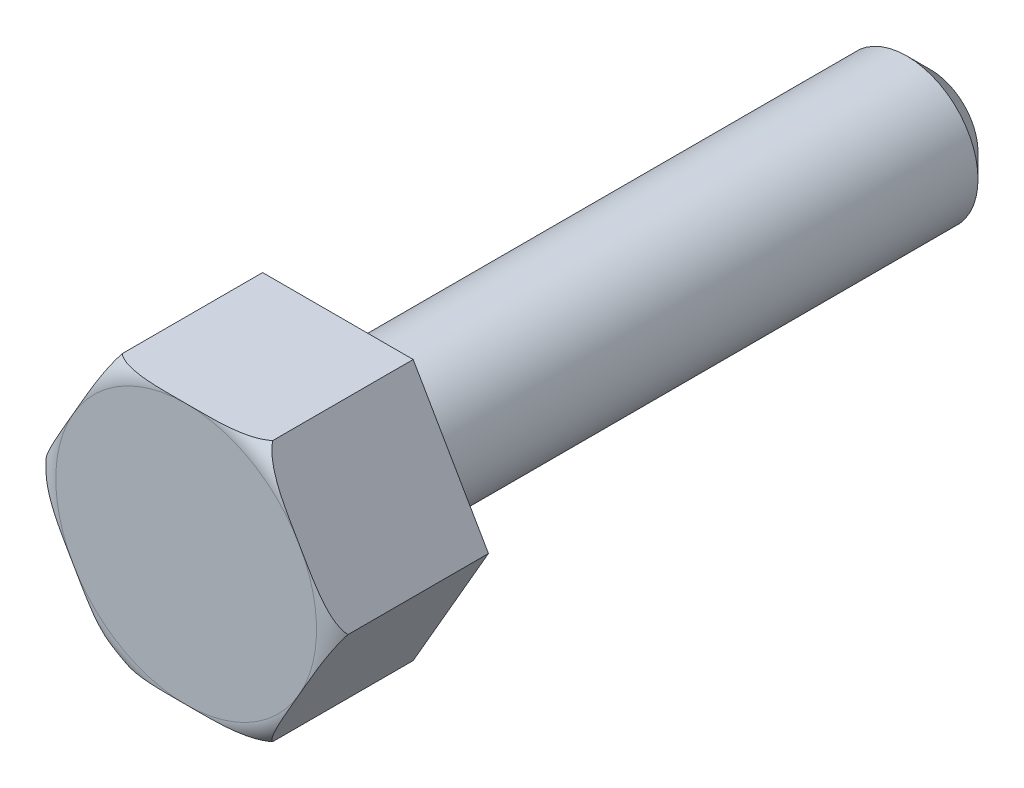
ISO-10303-21;
HEADER;
FILE_DESCRIPTION(('STEP AP214'),'2;1');
FILE_NAME('part.step','',(''),(''),'','','');
FILE_SCHEMA(('AUTOMOTIVE_DESIGN { 1 0 10303 214 1 1 1 1 }'));
ENDSEC;
DATA;
#1=APPLICATION_CONTEXT('core data for automotive mechanical design processes');
#2=APPLICATION_PROTOCOL_DEFINITION('international standard','automotive_design',2000,#1);
#3=PRODUCT_CONTEXT('',#1,'mechanical');
#4=PRODUCT('Part','Part','',(#3));
#5=PRODUCT_RELATED_PRODUCT_CATEGORY('part','',(#4));
#6=PRODUCT_DEFINITION_FORMATION('','',#4);
#7=PRODUCT_DEFINITION_CONTEXT('part definition',#1,'design');
#8=PRODUCT_DEFINITION('design','',#6,#7);
#9=PRODUCT_DEFINITION_SHAPE('','',#8);
#10=(LENGTH_UNIT() NAMED_UNIT(*) SI_UNIT(.MILLI.,.METRE.));
#11=(NAMED_UNIT(*) PLANE_ANGLE_UNIT() SI_UNIT($,.RADIAN.));
#12=(NAMED_UNIT(*) SI_UNIT($,.STERADIAN.) SOLID_ANGLE_UNIT());
#13=UNCERTAINTY_MEASURE_WITH_UNIT(LENGTH_MEASURE(1.E-05),#10,'distance_accuracy_value','');
#14=(GEOMETRIC_REPRESENTATION_CONTEXT(3) GLOBAL_UNCERTAINTY_ASSIGNED_CONTEXT((#13)) GLOBAL_UNIT_ASSIGNED_CONTEXT((#10,
#11,#12)) REPRESENTATION_CONTEXT('',''));
#15=CARTESIAN_POINT('',(0.,0.,0.));
#16=DIRECTION('',(0.,0.,1.));
#17=DIRECTION('',(1.,0.,0.));
#18=AXIS2_PLACEMENT_3D('',#15,#16,#17);
#19=CARTESIAN_POINT('',(0.,0.,0.));
#20=DIRECTION('',(0.,0.,1.));
#21=DIRECTION('',(1.,0.,0.));
#22=AXIS2_PLACEMENT_3D('',#19,#20,#21);
#23=PLANE('',#22);
#24=DIRECTION('',(0.5,0.866025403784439,0.));
#25=VECTOR('',#24,1.);
#26=CARTESIAN_POINT('',(3.17542648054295,-5.5,0.));
#27=LINE('',#26,#25);
#28=CARTESIAN_POINT('',(3.17542648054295,-5.5,0.));
#29=VERTEX_POINT('',#28);
#30=CARTESIAN_POINT('',(6.35085296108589,0.,0.));
#31=VERTEX_POINT('',#30);
#32=EDGE_CURVE('E39',#29,#31,#27,.T.);
#33=ORIENTED_EDGE('',*,*,#32,.F.);
#34=DIRECTION('',(1.,0.,0.));
#35=VECTOR('',#34,1.);
#36=CARTESIAN_POINT('',(-3.17542648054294,-5.5,0.));
#37=LINE('',#36,#35);
#38=CARTESIAN_POINT('',(-3.17542648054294,-5.5,0.));
#39=VERTEX_POINT('',#38);
#40=EDGE_CURVE('E121',#39,#29,#37,.T.);
#41=ORIENTED_EDGE('',*,*,#40,.F.);
#42=DIRECTION('',(0.5,-0.866025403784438,0.));
#43=VECTOR('',#42,1.);
#44=CARTESIAN_POINT('',(-6.35085296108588,0.,0.));
#45=LINE('',#44,#43);
#46=CARTESIAN_POINT('',(-6.35085296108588,0.,0.));
#47=VERTEX_POINT('',#46);
#48=EDGE_CURVE('E119',#47,#39,#45,.T.);
#49=ORIENTED_EDGE('',*,*,#48,.F.);
#50=DIRECTION('',(-0.5,-0.866025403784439,0.));
#51=VECTOR('',#50,1.);
#52=CARTESIAN_POINT('',(-3.17542648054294,5.5,0.));
#53=LINE('',#52,#51);
#54=CARTESIAN_POINT('',(-3.17542648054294,5.5,0.));
#55=VERTEX_POINT('',#54);
#56=EDGE_CURVE('E101',#55,#47,#53,.T.);
#57=ORIENTED_EDGE('',*,*,#56,.F.);
#58=DIRECTION('',(-1.,0.,0.));
#59=VECTOR('',#58,1.);
#60=CARTESIAN_POINT('',(3.17542648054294,5.5,0.));
#61=LINE('',#60,#59);
#62=CARTESIAN_POINT('',(3.17542648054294,5.5,0.));
#63=VERTEX_POINT('',#62);
#64=EDGE_CURVE('E110',#63,#55,#61,.T.);
#65=ORIENTED_EDGE('',*,*,#64,.F.);
#66=DIRECTION('',(-0.5,0.866025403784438,0.));
#67=VECTOR('',#66,1.);
#68=CARTESIAN_POINT('',(6.35085296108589,0.,0.));
#69=LINE('',#68,#67);
#70=EDGE_CURVE('E114',#31,#63,#69,.T.);
#71=ORIENTED_EDGE('',*,*,#70,.F.);
#72=EDGE_LOOP('',(#33,#41,#49,#57,#65,#71));
#73=FACE_BOUND('',#72,.T.);
#74=CARTESIAN_POINT('',(0.,0.,0.));
#75=DIRECTION('',(0.,0.,1.));
#76=DIRECTION('',(1.,0.,0.));
#77=AXIS2_PLACEMENT_3D('',#74,#75,#76);
#78=CIRCLE('',#77,3.);
#79=CARTESIAN_POINT('',(3.,0.,0.));
#80=VERTEX_POINT('',#79);
#81=EDGE_CURVE('E234',#80,#80,#78,.F.);
#82=ORIENTED_EDGE('',*,*,#81,.F.);
#83=EDGE_LOOP('',(#82));
#84=FACE_BOUND('',#83,.T.);
#85=ADVANCED_FACE('F24',(#73,#84),#23,.F.);
#86=CARTESIAN_POINT('',(0.,0.,5.4));
#87=DIRECTION('',(0.,0.,1.));
#88=DIRECTION('',(1.,0.,0.));
#89=AXIS2_PLACEMENT_3D('',#86,#87,#88);
#90=TOROIDAL_SURFACE('',#89,5.5,1.);
#91=CARTESIAN_POINT('',(0.,0.,6.4));
#92=DIRECTION('',(0.,0.,1.));
#93=DIRECTION('',(1.,0.,0.));
#94=AXIS2_PLACEMENT_3D('',#91,#92,#93);
#95=CIRCLE('',#94,5.5);
#96=CARTESIAN_POINT('',(4.76314265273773,-2.74999492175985,6.4));
#97=VERTEX_POINT('',#96);
#98=CARTESIAN_POINT('',(4.76313535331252,2.75000756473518,6.4));
#99=VERTEX_POINT('',#98);
#100=EDGE_CURVE('E131',#97,#99,#95,.T.);
#101=ORIENTED_EDGE('',*,*,#100,.F.);
#102=CARTESIAN_POINT('',(3.1753110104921,-5.50019999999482,5.92521683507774));
#103=CARTESIAN_POINT('',(3.19204964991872,-5.47120782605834,5.95230103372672));
#104=CARTESIAN_POINT('',(3.20952045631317,-5.44094750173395,5.97743459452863));
#105=CARTESIAN_POINT('',(3.24553671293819,-5.37856551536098,6.02417092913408));
#106=CARTESIAN_POINT('',(3.26407874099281,-5.34644978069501,6.04578418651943));
#107=CARTESIAN_POINT('',(3.32024084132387,-5.24917416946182,6.10543178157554));
#108=CARTESIAN_POINT('',(3.35899303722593,-5.18205339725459,6.13916841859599));
#109=CARTESIAN_POINT('',(3.44690474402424,-5.02978585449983,6.204254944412));
#110=CARTESIAN_POINT('',(3.49645581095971,-4.94396088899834,6.23338941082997));
#111=CARTESIAN_POINT('',(3.5967479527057,-4.77024980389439,6.28202540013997));
#112=CARTESIAN_POINT('',(3.6474907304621,-4.68236073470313,6.30151213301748));
#113=CARTESIAN_POINT('',(3.75032002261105,-4.5042551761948,6.3337017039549));
#114=CARTESIAN_POINT('',(3.8024150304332,-4.41402397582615,6.34629058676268));
#115=CARTESIAN_POINT('',(3.90680084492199,-4.2332224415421,6.36631100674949));
#116=CARTESIAN_POINT('',(3.95909149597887,-4.14265237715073,6.37374601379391));
#117=CARTESIAN_POINT('',(4.05934858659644,-3.96900200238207,6.38463652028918));
#118=CARTESIAN_POINT('',(4.10730801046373,-3.88593384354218,6.3883746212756));
#119=CARTESIAN_POINT('',(4.20325632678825,-3.71974648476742,6.39392233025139));
#120=CARTESIAN_POINT('',(4.25124522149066,-3.63662728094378,6.39573176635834));
#121=CARTESIAN_POINT('',(4.34724849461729,-3.47034473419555,6.39822111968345));
#122=CARTESIAN_POINT('',(4.39526287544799,-3.3871813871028,6.3989005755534));
#123=CARTESIAN_POINT('',(4.49129046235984,-3.22085672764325,6.39972406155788));
#124=CARTESIAN_POINT('',(4.53930366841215,-3.13769541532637,6.39986811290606));
#125=CARTESIAN_POINT('',(4.63499658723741,-2.97195041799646,6.40000529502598));
#126=CARTESIAN_POINT('',(4.6826763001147,-2.88936673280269,6.3999994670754));
#127=CARTESIAN_POINT('',(4.77803620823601,-2.72419852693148,6.4000003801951));
#128=CARTESIAN_POINT('',(4.82571640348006,-2.64161400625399,6.40000712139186));
#129=CARTESIAN_POINT('',(4.92106671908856,-2.47646241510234,6.39997335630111));
#130=CARTESIAN_POINT('',(4.96873683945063,-2.39389534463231,6.39993286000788));
#131=CARTESIAN_POINT('',(5.06407658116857,-2.22876206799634,6.39952529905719));
#132=CARTESIAN_POINT('',(5.11174620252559,-2.14619586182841,6.39915823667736));
#133=CARTESIAN_POINT('',(5.21225117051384,-1.97211615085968,6.39752797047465));
#134=CARTESIAN_POINT('',(5.26508624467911,-1.88060311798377,6.39617192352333));
#135=CARTESIAN_POINT('',(5.37074827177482,-1.69759111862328,6.39151281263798));
#136=CARTESIAN_POINT('',(5.4235752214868,-1.60609215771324,6.38820939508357));
#137=CARTESIAN_POINT('',(5.52932106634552,-1.42293498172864,6.37838403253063));
#138=CARTESIAN_POINT('',(5.5822397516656,-1.33127713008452,6.37185231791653));
#139=CARTESIAN_POINT('',(5.68787258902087,-1.14831568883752,6.35396290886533));
#140=CARTESIAN_POINT('',(5.74058680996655,-1.05701197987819,6.34260701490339));
#141=CARTESIAN_POINT('',(5.82421396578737,-0.912165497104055,6.31901443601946));
#142=CARTESIAN_POINT('',(5.85528265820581,-0.858352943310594,6.30901027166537));
#143=CARTESIAN_POINT('',(5.91714121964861,-0.751210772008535,6.28603008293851));
#144=CARTESIAN_POINT('',(5.94793115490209,-0.697881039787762,6.27305478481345));
#145=CARTESIAN_POINT('',(6.00888571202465,-0.592304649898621,6.24358892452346));
#146=CARTESIAN_POINT('',(6.03905309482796,-0.540053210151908,6.22712171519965));
#147=CARTESIAN_POINT('',(6.09870854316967,-0.436726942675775,6.18987188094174));
#148=CARTESIAN_POINT('',(6.12819682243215,-0.385651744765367,6.16909063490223));
#149=CARTESIAN_POINT('',(6.19155906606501,-0.275905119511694,6.11789743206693));
#150=CARTESIAN_POINT('',(6.2252264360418,-0.217591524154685,6.08641249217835));
#151=CARTESIAN_POINT('',(6.27396150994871,-0.133179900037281,6.03203709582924));
#152=CARTESIAN_POINT('',(6.28999100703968,-0.105415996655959,6.01260036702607));
#153=CARTESIAN_POINT('',(6.3211929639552,-0.0513726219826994,5.97101474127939));
#154=CARTESIAN_POINT('',(6.33636339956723,-0.0250966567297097,5.94885979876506));
#155=CARTESIAN_POINT('',(6.35096843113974,0.000200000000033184,5.92521683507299));
#156=B_SPLINE_CURVE_WITH_KNOTS('',3,(#102,#103,#104,#105,#106,#107,#108,#109,#110,#111,#112,
#113,#114,#115,#116,#117,#118,#119,#120,#121,#122,#123,#124,#125,#126,#127,#128,#129,#130,#131,
#132,#133,#134,#135,#136,#137,#138,#139,#140,#141,#142,#143,#144,#145,#146,#147,#148,#149,#150,
#151,#152,#153,#154,#155),.UNSPECIFIED.,.F.,.F.,(4,2,2,2,2,2,2,2,2,2,2,2,2,2,2,2,2,2,2,2,2,2,2,
2,2,2,4),(0.,0.128983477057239,0.257575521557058,0.510346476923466,0.819564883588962,
1.12925586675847,1.4439196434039,1.75837136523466,2.04631874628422,2.33429178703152,
2.62238237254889,2.91046154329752,3.1965398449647,3.48262102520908,3.76864168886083,
4.05466035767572,4.37168855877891,4.68877434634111,5.00682564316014,5.32475834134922,
5.51351411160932,5.70222379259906,5.8897091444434,6.07713466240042,6.2994825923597,
6.41183333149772,6.524438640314),.UNSPECIFIED.);
#157=CARTESIAN_POINT('',(6.35085296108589,0.,5.92540388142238));
#158=VERTEX_POINT('',#157);
#159=EDGE_CURVE('E194',#97,#158,#156,.T.);
#160=ORIENTED_EDGE('',*,*,#159,.T.);
#161=CARTESIAN_POINT('',(6.35096843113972,-0.000200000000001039,5.92521683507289));
#162=CARTESIAN_POINT('',(6.33422979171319,0.0287921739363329,5.95230103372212));
#163=CARTESIAN_POINT('',(6.3167589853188,0.0590524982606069,5.97743459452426));
#164=CARTESIAN_POINT('',(6.28074272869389,0.121434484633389,6.02417092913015));
#165=CARTESIAN_POINT('',(6.26220070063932,0.153550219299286,6.04578418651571));
#166=CARTESIAN_POINT('',(6.20603860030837,0.250825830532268,6.10543178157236));
#167=CARTESIAN_POINT('',(6.16728640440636,0.317946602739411,6.13916841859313));
#168=CARTESIAN_POINT('',(6.0793746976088,0.470214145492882,6.20425494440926));
#169=CARTESIAN_POINT('',(6.02982363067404,0.556039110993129,6.23338941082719));
#170=CARTESIAN_POINT('',(5.92953148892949,0.729750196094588,6.28202540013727));
#171=CARTESIAN_POINT('',(5.87878871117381,0.817639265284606,6.3015121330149));
#172=CARTESIAN_POINT('',(5.77595941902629,0.995744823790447,6.33370170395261));
#173=CARTESIAN_POINT('',(5.72386441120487,1.08597602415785,6.34629058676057));
#174=CARTESIAN_POINT('',(5.6194785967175,1.26677755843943,6.36631100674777));
#175=CARTESIAN_POINT('',(5.56718794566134,1.35734762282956,6.3737460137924));
#176=CARTESIAN_POINT('',(5.46693085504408,1.53099799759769,6.38463652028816));
#177=CARTESIAN_POINT('',(5.41897143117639,1.61406615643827,6.3883746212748));
#178=CARTESIAN_POINT('',(5.32302311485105,1.78025351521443,6.39392233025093));
#179=CARTESIAN_POINT('',(5.27503422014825,1.86337271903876,6.395731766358));
#180=CARTESIAN_POINT('',(5.1790309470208,2.02965526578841,6.39822111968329));
#181=CARTESIAN_POINT('',(5.13101656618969,2.11281861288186,6.39890057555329));
#182=CARTESIAN_POINT('',(5.03498897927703,2.27914327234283,6.39972406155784));
#183=CARTESIAN_POINT('',(4.98697577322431,2.36230458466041,6.39986811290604));
#184=CARTESIAN_POINT('',(4.89128285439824,2.52804958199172,6.40000529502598));
#185=CARTESIAN_POINT('',(4.84360314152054,2.61063326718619,6.3999994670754));
#186=CARTESIAN_POINT('',(4.74824323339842,2.77580147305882,6.4000003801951));
#187=CARTESIAN_POINT('',(4.70056303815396,2.85838599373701,6.40000712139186));
#188=CARTESIAN_POINT('',(4.60521272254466,3.02353758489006,6.39997335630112));
#189=CARTESIAN_POINT('',(4.55754260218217,3.1061046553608,6.39993286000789));
#190=CARTESIAN_POINT('',(4.46220286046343,3.27123793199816,6.39952529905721));
#191=CARTESIAN_POINT('',(4.414533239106,3.3538041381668,6.39915823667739));
#192=CARTESIAN_POINT('',(4.31402827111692,3.52788384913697,6.3975279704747));
#193=CARTESIAN_POINT('',(4.26119319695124,3.6193968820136,6.39617192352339));
#194=CARTESIAN_POINT('',(4.15553116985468,3.80240888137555,6.39151281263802));
#195=CARTESIAN_POINT('',(4.10270422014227,3.89390784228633,6.3882093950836));
#196=CARTESIAN_POINT('',(3.99695837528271,4.07706501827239,6.37838403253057));
#197=CARTESIAN_POINT('',(3.94403968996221,4.16872286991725,6.3718523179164));
#198=CARTESIAN_POINT('',(3.8384068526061,4.35168431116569,6.35396290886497));
#199=CARTESIAN_POINT('',(3.78569263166,4.44298802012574,6.34260701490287));
#200=CARTESIAN_POINT('',(3.70206547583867,4.58783450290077,6.3190144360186));
#201=CARTESIAN_POINT('',(3.67099678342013,4.6416470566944,6.3090102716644));
#202=CARTESIAN_POINT('',(3.60913822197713,4.7487892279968,6.28603008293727));
#203=CARTESIAN_POINT('',(3.57834828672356,4.80211896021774,6.27305478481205));
#204=CARTESIAN_POINT('',(3.51739372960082,4.9076953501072,6.2435889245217));
#205=CARTESIAN_POINT('',(3.48722634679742,4.95994678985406,6.22712171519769));
#206=CARTESIAN_POINT('',(3.42757089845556,5.06327305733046,6.1898718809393));
#207=CARTESIAN_POINT('',(3.39808261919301,5.11434825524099,6.16909063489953));
#208=CARTESIAN_POINT('',(3.33472037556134,5.22409488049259,6.11789743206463));
#209=CARTESIAN_POINT('',(3.30105300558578,5.28240847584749,6.08641249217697));
#210=CARTESIAN_POINT('',(3.25231793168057,5.36682009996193,6.03203709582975));
#211=CARTESIAN_POINT('',(3.23628843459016,5.39458400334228,6.0126003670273));
#212=CARTESIAN_POINT('',(3.20508647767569,5.44862737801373,5.97101474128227));
#213=CARTESIAN_POINT('',(3.18991604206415,5.47490334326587,5.94885979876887));
#214=CARTESIAN_POINT('',(3.17531101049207,5.50019999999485,5.92521683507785));
#215=B_SPLINE_CURVE_WITH_KNOTS('',3,(#161,#162,#163,#164,#165,#166,#167,#168,#169,#170,#171,
#172,#173,#174,#175,#176,#177,#178,#179,#180,#181,#182,#183,#184,#185,#186,#187,#188,#189,#190,
#191,#192,#193,#194,#195,#196,#197,#198,#199,#200,#201,#202,#203,#204,#205,#206,#207,#208,#209,
#210,#211,#212,#213,#214),.UNSPECIFIED.,.F.,.F.,(4,2,2,2,2,2,2,2,2,2,2,2,2,2,2,2,2,2,2,2,2,2,2,
2,2,2,4),(0.,0.128983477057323,0.257575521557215,0.510346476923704,0.819564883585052,
1.1292558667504,1.4439196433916,1.75837136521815,2.04631874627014,2.33429178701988,
2.6223823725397,2.91046154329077,3.19653984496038,3.4826210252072,3.76864168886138,
4.0546603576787,4.37168855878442,4.68877434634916,5.00682564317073,5.32475834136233,
5.51351411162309,5.70222379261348,5.88970914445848,6.07713466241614,6.29948259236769,
6.41183333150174,6.52443864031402),.UNSPECIFIED.);
#216=EDGE_CURVE('E162',#158,#99,#215,.T.);
#217=ORIENTED_EDGE('',*,*,#216,.T.);
#218=EDGE_LOOP('',(#101,#160,#217));
#219=FACE_BOUND('',#218,.T.);
#220=ADVANCED_FACE('F250',(#219),#90,.T.);
#221=CARTESIAN_POINT('',(0.,-5.5,6.4));
#222=VERTEX_POINT('',#221);
#223=EDGE_CURVE('E156',#222,#97,#95,.T.);
#224=ORIENTED_EDGE('',*,*,#223,.F.);
#225=CARTESIAN_POINT('',(0.,-5.5,6.4000000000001));
#226=CARTESIAN_POINT('',(0.0832868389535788,-5.5,6.40000014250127));
#227=CARTESIAN_POINT('',(0.166573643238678,-5.5,6.40000673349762));
#228=CARTESIAN_POINT('',(0.333148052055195,-5.5,6.39996108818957));
#229=CARTESIAN_POINT('',(0.416435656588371,-5.5,6.39990885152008));
#230=CARTESIAN_POINT('',(0.666420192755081,-5.5,6.3994120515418));
#231=CARTESIAN_POINT('',(0.833115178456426,-5.5,6.39862697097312));
#232=CARTESIAN_POINT('',(1.16696160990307,-5.5,6.39322457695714));
#233=CARTESIAN_POINT('',(1.33411301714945,-5.5,6.38859646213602));
#234=CARTESIAN_POINT('',(1.58442259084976,-5.5,6.37504656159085));
#235=CARTESIAN_POINT('',(1.66774786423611,-5.5,6.36943310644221));
#236=CARTESIAN_POINT('',(1.83413173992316,-5.5,6.35517088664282));
#237=CARTESIAN_POINT('',(1.91719039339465,-5.5,6.34652274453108));
#238=CARTESIAN_POINT('',(2.08442682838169,-5.5,6.32500581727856));
#239=CARTESIAN_POINT('',(2.1685947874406,-5.5,6.31205790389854));
#240=CARTESIAN_POINT('',(2.3358878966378,-5.5,6.28070734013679));
#241=CARTESIAN_POINT('',(2.41901370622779,-5.5,6.26230834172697));
#242=CARTESIAN_POINT('',(2.58280943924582,-5.5,6.21857729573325));
#243=CARTESIAN_POINT('',(2.66349299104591,-5.5,6.19329760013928));
#244=CARTESIAN_POINT('',(2.82137927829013,-5.5,6.13370210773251));
#245=CARTESIAN_POINT('',(2.89859065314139,-5.5,6.09941037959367));
#246=CARTESIAN_POINT('',(3.02486661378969,-5.5,6.03091933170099));
#247=CARTESIAN_POINT('',(3.07551585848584,-5.5,5.99967620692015));
#248=CARTESIAN_POINT('',(3.17183794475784,-5.5,5.93018931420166));
#249=CARTESIAN_POINT('',(3.21751875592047,-5.5,5.89195702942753));
#250=CARTESIAN_POINT('',(3.28707172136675,-5.5,5.82153697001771));
#251=CARTESIAN_POINT('',(3.3131539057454,-5.5,5.79154589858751));
#252=CARTESIAN_POINT('',(3.36044162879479,-5.5,5.72791244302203));
#253=CARTESIAN_POINT('',(3.38165363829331,-5.5,5.69427499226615));
#254=CARTESIAN_POINT('',(3.41436959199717,-5.5,5.63012134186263));
#255=CARTESIAN_POINT('',(3.42693802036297,-5.5,5.60015239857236));
#256=CARTESIAN_POINT('',(3.44691166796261,-5.5,5.53853316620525));
#257=CARTESIAN_POINT('',(3.4543210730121,-5.5,5.50688426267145));
#258=CARTESIAN_POINT('',(3.463378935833,-5.5,5.44260437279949));
#259=CARTESIAN_POINT('',(3.46500005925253,-5.5,5.40996945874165));
#260=CARTESIAN_POINT('',(3.46224978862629,-5.5,5.34495254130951));
#261=CARTESIAN_POINT('',(3.4578776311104,-5.5,5.3125705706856));
#262=CARTESIAN_POINT('',(3.44406054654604,-5.5,5.25136983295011));
#263=CARTESIAN_POINT('',(3.43500086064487,-5.5,5.22246187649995));
#264=CARTESIAN_POINT('',(3.41269026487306,-5.5,5.16633265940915));
#265=CARTESIAN_POINT('',(3.39943828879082,-5.5,5.13911182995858));
#266=CARTESIAN_POINT('',(3.36239728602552,-5.5,5.0743474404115));
#267=CARTESIAN_POINT('',(3.33658295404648,-5.5,5.03796326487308));
#268=CARTESIAN_POINT('',(3.27949752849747,-5.5,4.96974435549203));
#269=CARTESIAN_POINT('',(3.248211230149,-5.5,4.93792276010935));
#270=CARTESIAN_POINT('',(3.16253750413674,-5.5,4.86135639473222));
#271=CARTESIAN_POINT('',(3.10528681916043,-5.5,4.8198403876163));
#272=CARTESIAN_POINT('',(2.98540309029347,-5.5,4.74579862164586));
#273=CARTESIAN_POINT('',(2.92276403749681,-5.5,4.71328307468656));
#274=CARTESIAN_POINT('',(2.79638263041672,-5.5,4.65640312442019));
#275=CARTESIAN_POINT('',(2.73274141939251,-5.5,4.6318091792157));
#276=CARTESIAN_POINT('',(2.60358331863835,-5.5,4.58806580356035));
#277=CARTESIAN_POINT('',(2.53806453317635,-5.5,4.56892210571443));
#278=CARTESIAN_POINT('',(2.40558474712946,-5.5,4.53498073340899));
#279=CARTESIAN_POINT('',(2.33861817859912,-5.5,4.52020523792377));
#280=CARTESIAN_POINT('',(2.20405669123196,-5.5,4.4942863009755));
#281=CARTESIAN_POINT('',(2.13646231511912,-5.5,4.48313997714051));
#282=CARTESIAN_POINT('',(1.98872990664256,-5.5,4.46202385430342));
#283=CARTESIAN_POINT('',(1.90851225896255,-5.5,4.45262175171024));
#284=CARTESIAN_POINT('',(1.74776724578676,-5.5,4.43692106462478));
#285=CARTESIAN_POINT('',(1.66723981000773,-5.5,4.43062323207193));
#286=CARTESIAN_POINT('',(1.42528964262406,-5.5,4.41517238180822));
#287=CARTESIAN_POINT('',(1.26365700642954,-5.5,4.40948119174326));
#288=CARTESIAN_POINT('',(0.93971817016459,-5.5,4.4024907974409));
#289=CARTESIAN_POINT('',(0.777411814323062,-5.5,4.40120890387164));
#290=CARTESIAN_POINT('',(0.452898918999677,-5.5,4.39996755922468));
#291=CARTESIAN_POINT('',(0.290692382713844,-5.5,4.40000725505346));
#292=CARTESIAN_POINT('',(-0.0340835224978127,-5.5,4.39999498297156));
#293=CARTESIAN_POINT('',(-0.196652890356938,-5.5,4.39994280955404));
#294=CARTESIAN_POINT('',(-0.521866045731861,-5.5,4.40019457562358));
#295=CARTESIAN_POINT('',(-0.684509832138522,-5.5,4.40049868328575));
#296=CARTESIAN_POINT('',(-1.00930359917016,-5.5,4.40370771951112));
#297=CARTESIAN_POINT('',(-1.1714535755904,-5.5,4.40660472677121));
#298=CARTESIAN_POINT('',(-1.41445807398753,-5.5,4.41586149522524));
#299=CARTESIAN_POINT('',(-1.49539843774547,-5.5,4.41976370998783));
#300=CARTESIAN_POINT('',(-1.65713076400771,-5.5,4.42987775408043));
#301=CARTESIAN_POINT('',(-1.73792274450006,-5.5,4.43608928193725));
#302=CARTESIAN_POINT('',(-1.89940071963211,-5.5,4.45161610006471));
#303=CARTESIAN_POINT('',(-1.98008607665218,-5.5,4.4609382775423));
#304=CARTESIAN_POINT('',(-2.14096574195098,-5.5,4.48364817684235));
#305=CARTESIAN_POINT('',(-2.22115961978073,-5.5,4.49703905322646));
#306=CARTESIAN_POINT('',(-2.38012538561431,-5.5,4.5289837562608));
#307=CARTESIAN_POINT('',(-2.45890237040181,-5.5,4.54751150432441));
#308=CARTESIAN_POINT('',(-2.614553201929,-5.5,4.59121319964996));
#309=CARTESIAN_POINT('',(-2.69142920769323,-5.5,4.61637918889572));
#310=CARTESIAN_POINT('',(-2.84260723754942,-5.5,4.67551984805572));
#311=CARTESIAN_POINT('',(-2.91687919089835,-5.5,4.70957318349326));
#312=CARTESIAN_POINT('',(-3.05925012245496,-5.5,4.78888826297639));
#313=CARTESIAN_POINT('',(-3.12736958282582,-5.5,4.83411079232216));
#314=CARTESIAN_POINT('',(-3.22099854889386,-5.5,4.91258619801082));
#315=CARTESIAN_POINT('',(-3.25086235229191,-5.5,4.94062191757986));
#316=CARTESIAN_POINT('',(-3.30651805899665,-5.5,5.00055683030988));
#317=CARTESIAN_POINT('',(-3.33230955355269,-5.5,5.03245641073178));
#318=CARTESIAN_POINT('',(-3.37861416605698,-5.5,5.10058533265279));
#319=CARTESIAN_POINT('',(-3.39905247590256,-5.5,5.13686664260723));
#320=CARTESIAN_POINT('',(-3.43228583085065,-5.5,5.21278186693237));
#321=CARTESIAN_POINT('',(-3.44509791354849,-5.5,5.252408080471));
#322=CARTESIAN_POINT('',(-3.4603595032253,-5.5,5.32777850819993));
#323=CARTESIAN_POINT('',(-3.46402146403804,-5.5,5.36327569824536));
#324=CARTESIAN_POINT('',(-3.46417897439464,-5.5,5.43428436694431));
#325=CARTESIAN_POINT('',(-3.46067708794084,-5.5,5.46979583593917));
#326=CARTESIAN_POINT('',(-3.44793100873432,-5.5,5.53427855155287));
#327=CARTESIAN_POINT('',(-3.43961259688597,-5.5,5.56344036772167));
#328=CARTESIAN_POINT('',(-3.41866541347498,-5.5,5.6201539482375));
#329=CARTESIAN_POINT('',(-3.40603574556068,-5.5,5.64770537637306));
#330=CARTESIAN_POINT('',(-3.37090780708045,-5.5,5.7123512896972));
#331=CARTESIAN_POINT('',(-3.34650461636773,-5.5,5.74840884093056));
#332=CARTESIAN_POINT('',(-3.29226490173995,-5.5,5.81617327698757));
#333=CARTESIAN_POINT('',(-3.26241538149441,-5.5,5.8478694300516));
#334=CARTESIAN_POINT('',(-3.18101682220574,-5.5,5.92373972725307));
#335=CARTESIAN_POINT('',(-3.12669826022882,-5.5,5.96491973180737));
#336=CARTESIAN_POINT('',(-3.01260608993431,-5.5,6.03871976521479));
#337=CARTESIAN_POINT('',(-2.95282125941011,-5.5,6.07132162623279));
#338=CARTESIAN_POINT('',(-2.83290948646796,-5.5,6.128171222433));
#339=CARTESIAN_POINT('',(-2.77293187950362,-5.5,6.15274063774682));
#340=CARTESIAN_POINT('',(-2.65108597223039,-5.5,6.19672139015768));
#341=CARTESIAN_POINT('',(-2.5892158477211,-5.5,6.21612756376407));
#342=CARTESIAN_POINT('',(-2.46416758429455,-5.5,6.25074326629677));
#343=CARTESIAN_POINT('',(-2.4009865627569,-5.5,6.26594218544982));
#344=CARTESIAN_POINT('',(-2.27393387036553,-5.5,6.29284472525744));
#345=CARTESIAN_POINT('',(-2.21006257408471,-5.5,6.30455015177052));
#346=CARTESIAN_POINT('',(-2.05766432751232,-5.5,6.32900492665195));
#347=CARTESIAN_POINT('',(-1.96893543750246,-5.5,6.34047909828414));
#348=CARTESIAN_POINT('',(-1.79103954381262,-5.5,6.35940187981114));
#349=CARTESIAN_POINT('',(-1.7018723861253,-5.5,6.36684895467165));
#350=CARTESIAN_POINT('',(-1.52322292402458,-5.5,6.37881181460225));
#351=CARTESIAN_POINT('',(-1.43374035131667,-5.5,6.38332339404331));
#352=CARTESIAN_POINT('',(-1.25469222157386,-5.5,6.39029657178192));
#353=CARTESIAN_POINT('',(-1.16512665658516,-5.5,6.3927579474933));
#354=CARTESIAN_POINT('',(-0.985889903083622,-5.5,6.39636112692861));
#355=CARTESIAN_POINT('',(-0.896218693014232,-5.5,6.39750171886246));
#356=CARTESIAN_POINT('',(-0.716874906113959,-5.5,6.39903508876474));
#357=CARTESIAN_POINT('',(-0.627202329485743,-5.5,6.39942789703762));
#358=CARTESIAN_POINT('',(-0.447940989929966,-5.5,6.39988508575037));
#359=CARTESIAN_POINT('',(-0.35835222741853,-5.5,6.39994977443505));
#360=CARTESIAN_POINT('',(-0.179175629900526,-5.5,6.40000715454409));
#361=CARTESIAN_POINT('',(-0.089587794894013,-5.5,6.39999984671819));
#362=CARTESIAN_POINT('',(0.,-5.5,6.4000000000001));
#363=B_SPLINE_CURVE_WITH_KNOTS('',3,(#225,#226,#227,#228,#229,#230,#231,#232,#233,#234,#235,
#236,#237,#238,#239,#240,#241,#242,#243,#244,#245,#246,#247,#248,#249,#250,#251,#252,#253,#254,
#255,#256,#257,#258,#259,#260,#261,#262,#263,#264,#265,#266,#267,#268,#269,#270,#271,#272,#273,
#274,#275,#276,#277,#278,#279,#280,#281,#282,#283,#284,#285,#286,#287,#288,#289,#290,#291,#292,
#293,#294,#295,#296,#297,#298,#299,#300,#301,#302,#303,#304,#305,#306,#307,#308,#309,#310,#311,
#312,#313,#314,#315,#316,#317,#318,#319,#320,#321,#322,#323,#324,#325,#326,#327,#328,#329,#330,
#331,#332,#333,#334,#335,#336,#337,#338,#339,#340,#341,#342,#343,#344,#345,#346,#347,#348,#349,
#350,#351,#352,#353,#354,#355,#356,#357,#358,#359,#360,#361,#362),.UNSPECIFIED.,.T.,.F.,(4,2,2,
2,2,2,2,2,2,2,2,2,2,2,2,2,2,2,2,2,2,2,2,2,2,2,2,2,2,2,2,2,2,2,2,2,2,2,2,2,2,2,2,2,2,2,2,2,2,2,2,
2,2,2,2,2,2,2,2,2,2,2,2,2,2,2,2,2,4),(0.,0.249860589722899,0.499722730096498,0.999818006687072,
1.50132364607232,1.75182546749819,2.0022759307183,2.25761754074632,2.51278846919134,
2.76606971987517,3.01868128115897,3.19678224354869,3.37459317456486,3.49346874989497,
3.6121854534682,3.70928118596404,3.80629804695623,3.90377245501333,4.00125928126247,
4.09177260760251,4.18230897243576,4.31538548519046,4.4488378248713,4.65980043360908,
4.87100142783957,5.07537423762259,5.27996122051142,5.48556979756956,5.69101467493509,
5.9332325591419,6.17550908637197,6.66053860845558,7.14747017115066,7.63408742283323,
8.12179459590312,8.60973207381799,9.09618397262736,9.33926326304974,9.58231083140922,
9.82590013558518,10.0696787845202,10.3122418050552,10.5545153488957,10.7990107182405,
11.0426595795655,11.1652467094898,11.2878461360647,11.4120770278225,11.5360293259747,
11.6423930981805,11.7487188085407,11.8393206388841,11.9299413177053,12.0598228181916,
12.1900184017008,12.3933598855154,12.5971286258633,12.7912795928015,12.9856239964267,
13.1804541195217,13.37518335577,13.643451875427,13.9118225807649,14.1805769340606,
14.4493604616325,14.7183903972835,14.9874094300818,15.2561756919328,15.5249391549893),.UNSPECIFIED.);
#364=CARTESIAN_POINT('',(3.17542648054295,-5.5,5.92540388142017));
#365=VERTEX_POINT('',#364);
#366=EDGE_CURVE('E227',#222,#365,#363,.T.);
#367=ORIENTED_EDGE('',*,*,#366,.T.);
#368=EDGE_CURVE('E196',#365,#97,#156,.T.);
#369=ORIENTED_EDGE('',*,*,#368,.T.);
#370=EDGE_LOOP('',(#224,#367,#369));
#371=FACE_BOUND('',#370,.T.);
#372=ADVANCED_FACE('F255',(#371),#90,.T.);
#373=CARTESIAN_POINT('',(-6.35096843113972,0.00020000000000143,5.9252168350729));
#374=CARTESIAN_POINT('',(-6.33422979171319,-0.0287921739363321,5.95230103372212));
#375=CARTESIAN_POINT('',(-6.3167589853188,-0.0590524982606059,5.97743459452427));
#376=CARTESIAN_POINT('',(-6.28074272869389,-0.121434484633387,6.02417092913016));
#377=CARTESIAN_POINT('',(-6.26220070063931,-0.153550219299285,6.04578418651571));
#378=CARTESIAN_POINT('',(-6.20603860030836,-0.250825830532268,6.10543178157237));
#379=CARTESIAN_POINT('',(-6.16728640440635,-0.317946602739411,6.13916841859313));
#380=CARTESIAN_POINT('',(-6.0793746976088,-0.470214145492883,6.20425494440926));
#381=CARTESIAN_POINT('',(-6.02982363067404,-0.55603911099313,6.2333894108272));
#382=CARTESIAN_POINT('',(-5.92953148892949,-0.72975019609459,6.28202540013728));
#383=CARTESIAN_POINT('',(-5.87878871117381,-0.817639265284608,6.3015121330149));
#384=CARTESIAN_POINT('',(-5.77595941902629,-0.995744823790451,6.33370170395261));
#385=CARTESIAN_POINT('',(-5.72386441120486,-1.08597602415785,6.34629058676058));
#386=CARTESIAN_POINT('',(-5.6194785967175,-1.26677755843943,6.36631100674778));
#387=CARTESIAN_POINT('',(-5.56718794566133,-1.35734762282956,6.3737460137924));
#388=CARTESIAN_POINT('',(-5.46693085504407,-1.53099799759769,6.38463652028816));
#389=CARTESIAN_POINT('',(-5.41897143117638,-1.61406615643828,6.3883746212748));
#390=CARTESIAN_POINT('',(-5.32302311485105,-1.78025351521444,6.39392233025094));
#391=CARTESIAN_POINT('',(-5.27503422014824,-1.86337271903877,6.395731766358));
#392=CARTESIAN_POINT('',(-5.1790309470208,-2.02965526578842,6.39822111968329));
#393=CARTESIAN_POINT('',(-5.13101656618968,-2.11281861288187,6.39890057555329));
#394=CARTESIAN_POINT('',(-5.03498897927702,-2.27914327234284,6.39972406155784));
#395=CARTESIAN_POINT('',(-4.9869757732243,-2.36230458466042,6.39986811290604));
#396=CARTESIAN_POINT('',(-4.89128285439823,-2.52804958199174,6.40000529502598));
#397=CARTESIAN_POINT('',(-4.84360314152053,-2.61063326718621,6.3999994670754));
#398=CARTESIAN_POINT('',(-4.74824323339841,-2.77580147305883,6.4000003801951));
#399=CARTESIAN_POINT('',(-4.70056303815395,-2.85838599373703,6.40000712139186));
#400=CARTESIAN_POINT('',(-4.60521272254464,-3.02353758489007,6.39997335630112));
#401=CARTESIAN_POINT('',(-4.55754260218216,-3.10610465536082,6.39993286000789));
#402=CARTESIAN_POINT('',(-4.46220286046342,-3.27123793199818,6.39952529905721));
#403=CARTESIAN_POINT('',(-4.41453323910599,-3.35380413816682,6.39915823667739));
#404=CARTESIAN_POINT('',(-4.31402827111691,-3.52788384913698,6.3975279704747));
#405=CARTESIAN_POINT('',(-4.26119319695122,-3.61939688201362,6.39617192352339));
#406=CARTESIAN_POINT('',(-4.15553116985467,-3.80240888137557,6.39151281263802));
#407=CARTESIAN_POINT('',(-4.10270422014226,-3.89390784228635,6.3882093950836));
#408=CARTESIAN_POINT('',(-3.9969583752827,-4.0770650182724,6.37838403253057));
#409=CARTESIAN_POINT('',(-3.9440396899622,-4.16872286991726,6.3718523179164));
#410=CARTESIAN_POINT('',(-3.83840685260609,-4.3516843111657,6.35396290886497));
#411=CARTESIAN_POINT('',(-3.78569263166,-4.44298802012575,6.34260701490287));
#412=CARTESIAN_POINT('',(-3.70206547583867,-4.58783450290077,6.3190144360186));
#413=CARTESIAN_POINT('',(-3.67099678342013,-4.64164705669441,6.3090102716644));
#414=CARTESIAN_POINT('',(-3.60913822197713,-4.74878922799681,6.28603008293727));
#415=CARTESIAN_POINT('',(-3.57834828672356,-4.80211896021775,6.27305478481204));
#416=CARTESIAN_POINT('',(-3.51739372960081,-4.9076953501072,6.2435889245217));
#417=CARTESIAN_POINT('',(-3.48722634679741,-4.95994678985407,6.22712171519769));
#418=CARTESIAN_POINT('',(-3.42757089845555,-5.06327305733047,6.1898718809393));
#419=CARTESIAN_POINT('',(-3.398082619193,-5.11434825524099,6.16909063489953));
#420=CARTESIAN_POINT('',(-3.33472037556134,-5.22409488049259,6.11789743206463));
#421=CARTESIAN_POINT('',(-3.30105300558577,-5.28240847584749,6.08641249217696));
#422=CARTESIAN_POINT('',(-3.25231793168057,-5.36682009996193,6.03203709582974));
#423=CARTESIAN_POINT('',(-3.23628843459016,-5.39458400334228,6.0126003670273));
#424=CARTESIAN_POINT('',(-3.20508647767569,-5.44862737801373,5.97101474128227));
#425=CARTESIAN_POINT('',(-3.18991604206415,-5.47490334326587,5.94885979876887));
#426=CARTESIAN_POINT('',(-3.17531101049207,-5.50019999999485,5.92521683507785));
#427=B_SPLINE_CURVE_WITH_KNOTS('',3,(#373,#374,#375,#376,#377,#378,#379,#380,#381,#382,#383,
#384,#385,#386,#387,#388,#389,#390,#391,#392,#393,#394,#395,#396,#397,#398,#399,#400,#401,#402,
#403,#404,#405,#406,#407,#408,#409,#410,#411,#412,#413,#414,#415,#416,#417,#418,#419,#420,#421,
#422,#423,#424,#425,#426),.UNSPECIFIED.,.F.,.F.,(4,2,2,2,2,2,2,2,2,2,2,2,2,2,2,2,2,2,2,2,2,2,2,
2,2,2,4),(0.,0.128983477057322,0.257575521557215,0.510346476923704,0.819564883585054,
1.1292558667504,1.44391964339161,1.75837136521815,2.04631874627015,2.3342917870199,
2.62238237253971,2.91046154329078,3.1965398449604,3.48262102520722,3.7686416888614,
4.05466035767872,4.37168855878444,4.68877434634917,5.00682564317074,5.32475834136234,
5.5135141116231,5.70222379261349,5.88970914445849,6.07713466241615,6.2994825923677,
6.41183333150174,6.52443864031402),.UNSPECIFIED.);
#428=CARTESIAN_POINT('',(-4.76313959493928,-2.75000021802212,6.4));
#429=VERTEX_POINT('',#428);
#430=CARTESIAN_POINT('',(-3.17542648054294,-5.5,5.92540388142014));
#431=VERTEX_POINT('',#430);
#432=EDGE_CURVE('E232',#429,#431,#427,.T.);
#433=ORIENTED_EDGE('',*,*,#432,.T.);
#434=EDGE_CURVE('E233',#431,#222,#363,.T.);
#435=ORIENTED_EDGE('',*,*,#434,.T.);
#436=EDGE_CURVE('E154',#429,#222,#95,.T.);
#437=ORIENTED_EDGE('',*,*,#436,.F.);
#438=EDGE_LOOP('',(#433,#435,#437));
#439=FACE_BOUND('',#438,.T.);
#440=ADVANCED_FACE('F172',(#439),#90,.T.);
#441=CARTESIAN_POINT('',(-3.17531101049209,5.50019999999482,5.92521683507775));
#442=CARTESIAN_POINT('',(-3.19204964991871,5.47120782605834,5.95230103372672));
#443=CARTESIAN_POINT('',(-3.20952045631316,5.44094750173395,5.97743459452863));
#444=CARTESIAN_POINT('',(-3.24553671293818,5.37856551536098,6.02417092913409));
#445=CARTESIAN_POINT('',(-3.26407874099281,5.34644978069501,6.04578418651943));
#446=CARTESIAN_POINT('',(-3.32024084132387,5.24917416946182,6.10543178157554));
#447=CARTESIAN_POINT('',(-3.35899303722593,5.18205339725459,6.13916841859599));
#448=CARTESIAN_POINT('',(-3.44690474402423,5.02978585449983,6.204254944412));
#449=CARTESIAN_POINT('',(-3.49645581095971,4.94396088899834,6.23338941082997));
#450=CARTESIAN_POINT('',(-3.59674795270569,4.77024980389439,6.28202540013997));
#451=CARTESIAN_POINT('',(-3.6474907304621,4.68236073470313,6.30151213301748));
#452=CARTESIAN_POINT('',(-3.75032002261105,4.5042551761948,6.3337017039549));
#453=CARTESIAN_POINT('',(-3.80241503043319,4.41402397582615,6.34629058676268));
#454=CARTESIAN_POINT('',(-3.90680084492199,4.23322244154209,6.36631100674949));
#455=CARTESIAN_POINT('',(-3.95909149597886,4.14265237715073,6.37374601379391));
#456=CARTESIAN_POINT('',(-4.05934858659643,3.96900200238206,6.38463652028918));
#457=CARTESIAN_POINT('',(-4.10730801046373,3.88593384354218,6.3883746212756));
#458=CARTESIAN_POINT('',(-4.20325632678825,3.71974648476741,6.39392233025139));
#459=CARTESIAN_POINT('',(-4.25124522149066,3.63662728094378,6.39573176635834));
#460=CARTESIAN_POINT('',(-4.34724849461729,3.47034473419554,6.39822111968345));
#461=CARTESIAN_POINT('',(-4.39526287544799,3.38718138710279,6.3989005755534));
#462=CARTESIAN_POINT('',(-4.49129046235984,3.22085672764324,6.39972406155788));
#463=CARTESIAN_POINT('',(-4.53930366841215,3.13769541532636,6.39986811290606));
#464=CARTESIAN_POINT('',(-4.63499658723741,2.97195041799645,6.40000529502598));
#465=CARTESIAN_POINT('',(-4.6826763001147,2.88936673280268,6.3999994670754));
#466=CARTESIAN_POINT('',(-4.77803620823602,2.72419852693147,6.4000003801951));
#467=CARTESIAN_POINT('',(-4.82571640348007,2.64161400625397,6.40000712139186));
#468=CARTESIAN_POINT('',(-4.92106671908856,2.47646241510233,6.39997335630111));
#469=CARTESIAN_POINT('',(-4.96873683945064,2.39389534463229,6.39993286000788));
#470=CARTESIAN_POINT('',(-5.06407658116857,2.22876206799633,6.39952529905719));
#471=CARTESIAN_POINT('',(-5.1117462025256,2.14619586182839,6.39915823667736));
#472=CARTESIAN_POINT('',(-5.21225117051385,1.97211615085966,6.39752797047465));
#473=CARTESIAN_POINT('',(-5.26508624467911,1.88060311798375,6.39617192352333));
#474=CARTESIAN_POINT('',(-5.37074827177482,1.69759111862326,6.39151281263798));
#475=CARTESIAN_POINT('',(-5.42357522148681,1.60609215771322,6.38820939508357));
#476=CARTESIAN_POINT('',(-5.52932106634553,1.42293498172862,6.37838403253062));
#477=CARTESIAN_POINT('',(-5.58223975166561,1.3312771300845,6.37185231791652));
#478=CARTESIAN_POINT('',(-5.68787258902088,1.1483156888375,6.35396290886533));
#479=CARTESIAN_POINT('',(-5.74058680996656,1.05701197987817,6.34260701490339));
#480=CARTESIAN_POINT('',(-5.82421396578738,0.912165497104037,6.31901443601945));
#481=CARTESIAN_POINT('',(-5.85528265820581,0.858352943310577,6.30901027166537));
#482=CARTESIAN_POINT('',(-5.91714121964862,0.751210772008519,6.28603008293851));
#483=CARTESIAN_POINT('',(-5.94793115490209,0.697881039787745,6.27305478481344));
#484=CARTESIAN_POINT('',(-6.00888571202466,0.592304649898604,6.24358892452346));
#485=CARTESIAN_POINT('',(-6.03905309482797,0.540053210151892,6.22712171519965));
#486=CARTESIAN_POINT('',(-6.09870854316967,0.436726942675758,6.18987188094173));
#487=CARTESIAN_POINT('',(-6.12819682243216,0.385651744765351,6.16909063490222));
#488=CARTESIAN_POINT('',(-6.19155906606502,0.275905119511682,6.11789743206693));
#489=CARTESIAN_POINT('',(-6.2252264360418,0.217591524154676,6.08641249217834));
#490=CARTESIAN_POINT('',(-6.27396150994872,0.133179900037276,6.03203709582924));
#491=CARTESIAN_POINT('',(-6.28999100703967,0.105415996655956,6.01260036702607));
#492=CARTESIAN_POINT('',(-6.32119296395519,0.0513726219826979,5.9710147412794));
#493=CARTESIAN_POINT('',(-6.33636339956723,0.0250966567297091,5.94885979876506));
#494=CARTESIAN_POINT('',(-6.35096843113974,-0.000200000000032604,5.925216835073));
#495=B_SPLINE_CURVE_WITH_KNOTS('',3,(#441,#442,#443,#444,#445,#446,#447,#448,#449,#450,#451,
#452,#453,#454,#455,#456,#457,#458,#459,#460,#461,#462,#463,#464,#465,#466,#467,#468,#469,#470,
#471,#472,#473,#474,#475,#476,#477,#478,#479,#480,#481,#482,#483,#484,#485,#486,#487,#488,#489,
#490,#491,#492,#493,#494),.UNSPECIFIED.,.F.,.F.,(4,2,2,2,2,2,2,2,2,2,2,2,2,2,2,2,2,2,2,2,2,2,2,
2,2,2,4),(0.,0.128983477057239,0.257575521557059,0.510346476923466,0.819564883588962,
1.12925586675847,1.4439196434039,1.75837136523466,2.04631874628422,2.33429178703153,
2.6223823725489,2.91046154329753,3.19653984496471,3.4826210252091,3.76864168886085,
4.05466035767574,4.37168855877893,4.68877434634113,5.00682564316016,5.32475834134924,
5.51351411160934,5.70222379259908,5.88970914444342,6.07713466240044,6.29948259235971,
6.41183333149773,6.524438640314),.UNSPECIFIED.);
#496=CARTESIAN_POINT('',(-4.76314337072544,2.74999367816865,6.4));
#497=VERTEX_POINT('',#496);
#498=CARTESIAN_POINT('',(-6.35085296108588,0.,5.92540388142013));
#499=VERTEX_POINT('',#498);
#500=EDGE_CURVE('E200',#497,#499,#495,.T.);
#501=ORIENTED_EDGE('',*,*,#500,.T.);
#502=EDGE_CURVE('E203',#499,#429,#427,.T.);
#503=ORIENTED_EDGE('',*,*,#502,.T.);
#504=EDGE_CURVE('E152',#497,#429,#95,.T.);
#505=ORIENTED_EDGE('',*,*,#504,.F.);
#506=EDGE_LOOP('',(#501,#503,#505));
#507=FACE_BOUND('',#506,.T.);
#508=ADVANCED_FACE('F258',(#507),#90,.T.);
#509=CARTESIAN_POINT('',(0.,5.5,6.4000000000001));
#510=CARTESIAN_POINT('',(-0.0832868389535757,5.5,6.40000014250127));
#511=CARTESIAN_POINT('',(-0.166573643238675,5.5,6.40000673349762));
#512=CARTESIAN_POINT('',(-0.333148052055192,5.5,6.39996108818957));
#513=CARTESIAN_POINT('',(-0.416435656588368,5.5,6.39990885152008));
#514=CARTESIAN_POINT('',(-0.666420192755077,5.5,6.3994120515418));
#515=CARTESIAN_POINT('',(-0.833115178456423,5.5,6.39862697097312));
#516=CARTESIAN_POINT('',(-1.16696160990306,5.5,6.39322457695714));
#517=CARTESIAN_POINT('',(-1.33411301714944,5.5,6.38859646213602));
#518=CARTESIAN_POINT('',(-1.58442259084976,5.5,6.37504656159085));
#519=CARTESIAN_POINT('',(-1.6677478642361,5.5,6.36943310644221));
#520=CARTESIAN_POINT('',(-1.83413173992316,5.5,6.35517088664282));
#521=CARTESIAN_POINT('',(-1.91719039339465,5.5,6.34652274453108));
#522=CARTESIAN_POINT('',(-2.08442682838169,5.5,6.32500581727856));
#523=CARTESIAN_POINT('',(-2.1685947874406,5.5,6.31205790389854));
#524=CARTESIAN_POINT('',(-2.33588789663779,5.5,6.28070734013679));
#525=CARTESIAN_POINT('',(-2.41901370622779,5.5,6.26230834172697));
#526=CARTESIAN_POINT('',(-2.58280943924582,5.5,6.21857729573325));
#527=CARTESIAN_POINT('',(-2.6634929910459,5.5,6.19329760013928));
#528=CARTESIAN_POINT('',(-2.82137927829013,5.5,6.13370210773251));
#529=CARTESIAN_POINT('',(-2.89859065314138,5.5,6.09941037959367));
#530=CARTESIAN_POINT('',(-3.02486661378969,5.5,6.03091933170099));
#531=CARTESIAN_POINT('',(-3.07551585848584,5.5,5.99967620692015));
#532=CARTESIAN_POINT('',(-3.17183794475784,5.5,5.93018931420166));
#533=CARTESIAN_POINT('',(-3.21751875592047,5.5,5.89195702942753));
#534=CARTESIAN_POINT('',(-3.28707172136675,5.5,5.82153697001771));
#535=CARTESIAN_POINT('',(-3.3131539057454,5.5,5.79154589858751));
#536=CARTESIAN_POINT('',(-3.36044162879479,5.5,5.72791244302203));
#537=CARTESIAN_POINT('',(-3.38165363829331,5.5,5.69427499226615));
#538=CARTESIAN_POINT('',(-3.41436959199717,5.5,5.63012134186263));
#539=CARTESIAN_POINT('',(-3.42693802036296,5.5,5.60015239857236));
#540=CARTESIAN_POINT('',(-3.44691166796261,5.5,5.53853316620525));
#541=CARTESIAN_POINT('',(-3.4543210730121,5.5,5.50688426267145));
#542=CARTESIAN_POINT('',(-3.463378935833,5.5,5.44260437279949));
#543=CARTESIAN_POINT('',(-3.46500005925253,5.5,5.40996945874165));
#544=CARTESIAN_POINT('',(-3.46224978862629,5.5,5.34495254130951));
#545=CARTESIAN_POINT('',(-3.4578776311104,5.5,5.31257057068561));
#546=CARTESIAN_POINT('',(-3.44406054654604,5.5,5.25136983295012));
#547=CARTESIAN_POINT('',(-3.43500086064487,5.5,5.22246187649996));
#548=CARTESIAN_POINT('',(-3.41269026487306,5.5,5.16633265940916));
#549=CARTESIAN_POINT('',(-3.39943828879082,5.5,5.13911182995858));
#550=CARTESIAN_POINT('',(-3.36239728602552,5.5,5.07434744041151));
#551=CARTESIAN_POINT('',(-3.33658295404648,5.5,5.03796326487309));
#552=CARTESIAN_POINT('',(-3.27949752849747,5.5,4.96974435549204));
#553=CARTESIAN_POINT('',(-3.24821123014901,5.5,4.93792276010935));
#554=CARTESIAN_POINT('',(-3.16253750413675,5.5,4.86135639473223));
#555=CARTESIAN_POINT('',(-3.10528681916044,5.5,4.8198403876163));
#556=CARTESIAN_POINT('',(-2.98540309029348,5.5,4.74579862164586));
#557=CARTESIAN_POINT('',(-2.92276403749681,5.5,4.71328307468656));
#558=CARTESIAN_POINT('',(-2.79638263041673,5.5,4.65640312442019));
#559=CARTESIAN_POINT('',(-2.73274141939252,5.5,4.63180917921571));
#560=CARTESIAN_POINT('',(-2.60358331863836,5.5,4.58806580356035));
#561=CARTESIAN_POINT('',(-2.53806453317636,5.5,4.56892210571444));
#562=CARTESIAN_POINT('',(-2.40558474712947,5.5,4.534980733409));
#563=CARTESIAN_POINT('',(-2.33861817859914,5.5,4.52020523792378));
#564=CARTESIAN_POINT('',(-2.20405669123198,5.5,4.4942863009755));
#565=CARTESIAN_POINT('',(-2.13646231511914,5.5,4.48313997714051));
#566=CARTESIAN_POINT('',(-1.98872990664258,5.5,4.46202385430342));
#567=CARTESIAN_POINT('',(-1.90851225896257,5.5,4.45262175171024));
#568=CARTESIAN_POINT('',(-1.74776724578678,5.5,4.43692106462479));
#569=CARTESIAN_POINT('',(-1.66723981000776,5.5,4.43062323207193));
#570=CARTESIAN_POINT('',(-1.42528964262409,5.5,4.41517238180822));
#571=CARTESIAN_POINT('',(-1.26365700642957,5.5,4.40948119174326));
#572=CARTESIAN_POINT('',(-0.939718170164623,5.5,4.4024907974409));
#573=CARTESIAN_POINT('',(-0.777411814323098,5.5,4.40120890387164));
#574=CARTESIAN_POINT('',(-0.452898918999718,5.5,4.39996755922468));
#575=CARTESIAN_POINT('',(-0.290692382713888,5.5,4.40000725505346));
#576=CARTESIAN_POINT('',(0.0340835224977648,5.5,4.39999498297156));
#577=CARTESIAN_POINT('',(0.196652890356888,5.5,4.39994280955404));
#578=CARTESIAN_POINT('',(0.521866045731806,5.5,4.40019457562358));
#579=CARTESIAN_POINT('',(0.684509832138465,5.5,4.40049868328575));
#580=CARTESIAN_POINT('',(1.0093035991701,5.5,4.40370771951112));
#581=CARTESIAN_POINT('',(1.17145357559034,5.5,4.40660472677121));
#582=CARTESIAN_POINT('',(1.41445807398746,5.5,4.41586149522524));
#583=CARTESIAN_POINT('',(1.4953984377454,5.5,4.41976370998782));
#584=CARTESIAN_POINT('',(1.65713076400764,5.5,4.42987775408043));
#585=CARTESIAN_POINT('',(1.73792274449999,5.5,4.43608928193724));
#586=CARTESIAN_POINT('',(1.89940071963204,5.5,4.4516161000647));
#587=CARTESIAN_POINT('',(1.98008607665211,5.5,4.46093827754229));
#588=CARTESIAN_POINT('',(2.1409657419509,5.5,4.48364817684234));
#589=CARTESIAN_POINT('',(2.22115961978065,5.5,4.49703905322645));
#590=CARTESIAN_POINT('',(2.38012538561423,5.5,4.52898375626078));
#591=CARTESIAN_POINT('',(2.45890237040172,5.5,4.54751150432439));
#592=CARTESIAN_POINT('',(2.61455320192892,5.5,4.59121319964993));
#593=CARTESIAN_POINT('',(2.69142920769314,5.5,4.61637918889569));
#594=CARTESIAN_POINT('',(2.84260723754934,5.5,4.67551984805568));
#595=CARTESIAN_POINT('',(2.91687919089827,5.5,4.70957318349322));
#596=CARTESIAN_POINT('',(3.05925012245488,5.5,4.78888826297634));
#597=CARTESIAN_POINT('',(3.12736958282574,5.5,4.83411079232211));
#598=CARTESIAN_POINT('',(3.22099854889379,5.5,4.91258619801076));
#599=CARTESIAN_POINT('',(3.25086235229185,5.5,4.9406219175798));
#600=CARTESIAN_POINT('',(3.3065180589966,5.5,5.00055683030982));
#601=CARTESIAN_POINT('',(3.33230955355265,5.5,5.03245641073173));
#602=CARTESIAN_POINT('',(3.37861416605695,5.5,5.10058533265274));
#603=CARTESIAN_POINT('',(3.39905247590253,5.5,5.13686664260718));
#604=CARTESIAN_POINT('',(3.43228583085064,5.5,5.21278186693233));
#605=CARTESIAN_POINT('',(3.44509791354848,5.5,5.25240808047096));
#606=CARTESIAN_POINT('',(3.46035950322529,5.5,5.3277785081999));
#607=CARTESIAN_POINT('',(3.46402146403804,5.5,5.36327569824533));
#608=CARTESIAN_POINT('',(3.46417897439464,5.5,5.43428436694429));
#609=CARTESIAN_POINT('',(3.46067708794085,5.5,5.46979583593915));
#610=CARTESIAN_POINT('',(3.44793100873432,5.5,5.53427855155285));
#611=CARTESIAN_POINT('',(3.43961259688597,5.5,5.56344036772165));
#612=CARTESIAN_POINT('',(3.41866541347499,5.5,5.62015394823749));
#613=CARTESIAN_POINT('',(3.40603574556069,5.5,5.64770537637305));
#614=CARTESIAN_POINT('',(3.37090780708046,5.5,5.71235128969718));
#615=CARTESIAN_POINT('',(3.34650461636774,5.5,5.74840884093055));
#616=CARTESIAN_POINT('',(3.29226490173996,5.5,5.81617327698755));
#617=CARTESIAN_POINT('',(3.26241538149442,5.5,5.84786943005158));
#618=CARTESIAN_POINT('',(3.18101682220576,5.5,5.92373972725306));
#619=CARTESIAN_POINT('',(3.12669826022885,5.5,5.96491973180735));
#620=CARTESIAN_POINT('',(3.01260608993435,5.5,6.03871976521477));
#621=CARTESIAN_POINT('',(2.95282125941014,5.5,6.07132162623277));
#622=CARTESIAN_POINT('',(2.83290948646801,5.5,6.12817122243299));
#623=CARTESIAN_POINT('',(2.77293187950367,5.5,6.1527406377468));
#624=CARTESIAN_POINT('',(2.65108597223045,5.5,6.19672139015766));
#625=CARTESIAN_POINT('',(2.58921584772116,5.5,6.21612756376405));
#626=CARTESIAN_POINT('',(2.46416758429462,5.5,6.25074326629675));
#627=CARTESIAN_POINT('',(2.40098656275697,5.5,6.2659421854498));
#628=CARTESIAN_POINT('',(2.27393387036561,5.5,6.29284472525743));
#629=CARTESIAN_POINT('',(2.2100625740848,5.5,6.30455015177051));
#630=CARTESIAN_POINT('',(2.05766432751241,5.5,6.32900492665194));
#631=CARTESIAN_POINT('',(1.96893543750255,5.5,6.34047909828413));
#632=CARTESIAN_POINT('',(1.79103954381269,5.5,6.35940187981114));
#633=CARTESIAN_POINT('',(1.70187238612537,5.5,6.36684895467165));
#634=CARTESIAN_POINT('',(1.52322292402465,5.5,6.37881181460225));
#635=CARTESIAN_POINT('',(1.43374035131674,5.5,6.3833233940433));
#636=CARTESIAN_POINT('',(1.25469222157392,5.5,6.39029657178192));
#637=CARTESIAN_POINT('',(1.16512665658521,5.5,6.3927579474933));
#638=CARTESIAN_POINT('',(0.985889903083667,5.5,6.39636112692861));
#639=CARTESIAN_POINT('',(0.896218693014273,5.5,6.39750171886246));
#640=CARTESIAN_POINT('',(0.716874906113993,5.5,6.39903508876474));
#641=CARTESIAN_POINT('',(0.627202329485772,5.5,6.39942789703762));
#642=CARTESIAN_POINT('',(0.447940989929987,5.5,6.39988508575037));
#643=CARTESIAN_POINT('',(0.358352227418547,5.5,6.39994977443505));
#644=CARTESIAN_POINT('',(0.179175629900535,5.5,6.40000715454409));
#645=CARTESIAN_POINT('',(0.0895877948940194,5.5,6.39999984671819));
#646=CARTESIAN_POINT('',(0.,5.5,6.4000000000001));
#647=B_SPLINE_CURVE_WITH_KNOTS('',3,(#509,#510,#511,#512,#513,#514,#515,#516,#517,#518,#519,
#520,#521,#522,#523,#524,#525,#526,#527,#528,#529,#530,#531,#532,#533,#534,#535,#536,#537,#538,
#539,#540,#541,#542,#543,#544,#545,#546,#547,#548,#549,#550,#551,#552,#553,#554,#555,#556,#557,
#558,#559,#560,#561,#562,#563,#564,#565,#566,#567,#568,#569,#570,#571,#572,#573,#574,#575,#576,
#577,#578,#579,#580,#581,#582,#583,#584,#585,#586,#587,#588,#589,#590,#591,#592,#593,#594,#595,
#596,#597,#598,#599,#600,#601,#602,#603,#604,#605,#606,#607,#608,#609,#610,#611,#612,#613,#614,
#615,#616,#617,#618,#619,#620,#621,#622,#623,#624,#625,#626,#627,#628,#629,#630,#631,#632,#633,
#634,#635,#636,#637,#638,#639,#640,#641,#642,#643,#644,#645,#646),.UNSPECIFIED.,.T.,.F.,(4,2,2,
2,2,2,2,2,2,2,2,2,2,2,2,2,2,2,2,2,2,2,2,2,2,2,2,2,2,2,2,2,2,2,2,2,2,2,2,2,2,2,2,2,2,2,2,2,2,2,2,
2,2,2,2,2,2,2,2,2,2,2,2,2,2,2,2,2,4),(0.,0.249860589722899,0.499722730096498,0.999818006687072,
1.50132364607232,1.75182546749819,2.0022759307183,2.25761754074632,2.51278846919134,
2.76606971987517,3.01868128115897,3.19678224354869,3.37459317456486,3.49346874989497,
3.6121854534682,3.70928118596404,3.80629804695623,3.90377245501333,4.00125928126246,
4.0917726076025,4.18230897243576,4.31538548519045,4.44883782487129,4.65980043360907,
4.87100142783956,5.07537423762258,5.27996122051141,5.48556979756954,5.69101467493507,
5.93323255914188,6.17550908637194,6.66053860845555,7.14747017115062,7.63408742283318,
8.12179459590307,8.60973207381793,9.09618397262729,9.33926326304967,9.58231083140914,
9.8259001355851,10.0696787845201,10.3122418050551,10.5545153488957,10.7990107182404,
11.0426595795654,11.1652467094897,11.2878461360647,11.4120770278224,11.5360293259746,
11.6423930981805,11.7487188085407,11.8393206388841,11.9299413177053,12.0598228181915,
12.1900184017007,12.3933598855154,12.5971286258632,12.7912795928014,12.9856239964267,
13.1804541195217,13.3751833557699,13.6434518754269,13.9118225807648,14.1805769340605,
14.4493604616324,14.7183903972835,14.9874094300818,15.2561756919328,15.5249391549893),.UNSPECIFIED.);
#648=CARTESIAN_POINT('',(0.,5.5,6.4));
#649=VERTEX_POINT('',#648);
#650=CARTESIAN_POINT('',(-3.17542648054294,5.5,5.92540388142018));
#651=VERTEX_POINT('',#650);
#652=EDGE_CURVE('E278',#649,#651,#647,.T.);
#653=ORIENTED_EDGE('',*,*,#652,.T.);
#654=EDGE_CURVE('E104',#651,#497,#495,.T.);
#655=ORIENTED_EDGE('',*,*,#654,.T.);
#656=EDGE_CURVE('E142',#649,#497,#95,.T.);
#657=ORIENTED_EDGE('',*,*,#656,.F.);
#658=EDGE_LOOP('',(#653,#655,#657));
#659=FACE_BOUND('',#658,.T.);
#660=ADVANCED_FACE('F257',(#659),#90,.T.);
#661=CARTESIAN_POINT('',(0.,0.,6.4));
#662=DIRECTION('',(0.,0.,1.));
#663=DIRECTION('',(1.,0.,0.));
#664=AXIS2_PLACEMENT_3D('',#661,#662,#663);
#665=PLANE('',#664);
#666=EDGE_CURVE('E138',#99,#649,#95,.T.);
#667=ORIENTED_EDGE('',*,*,#666,.T.);
#668=ORIENTED_EDGE('',*,*,#656,.T.);
#669=ORIENTED_EDGE('',*,*,#504,.T.);
#670=ORIENTED_EDGE('',*,*,#436,.T.);
#671=ORIENTED_EDGE('',*,*,#223,.T.);
#672=ORIENTED_EDGE('',*,*,#100,.T.);
#673=EDGE_LOOP('',(#667,#668,#669,#670,#671,#672));
#674=FACE_BOUND('',#673,.T.);
#675=ADVANCED_FACE('F26',(#674),#665,.T.);
#676=CARTESIAN_POINT('',(3.17542648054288,5.5000000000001,5.92540388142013));
#677=VERTEX_POINT('',#676);
#678=EDGE_CURVE('E141',#99,#677,#215,.T.);
#679=ORIENTED_EDGE('',*,*,#678,.T.);
#680=EDGE_CURVE('E280',#677,#649,#647,.T.);
#681=ORIENTED_EDGE('',*,*,#680,.T.);
#682=ORIENTED_EDGE('',*,*,#666,.F.);
#683=EDGE_LOOP('',(#679,#681,#682));
#684=FACE_BOUND('',#683,.T.);
#685=ADVANCED_FACE('F186',(#684),#90,.T.);
#686=CARTESIAN_POINT('',(3.17542648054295,-5.5,0.));
#687=DIRECTION('',(0.866025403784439,-0.5,0.));
#688=DIRECTION('',(0.5,0.866025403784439,0.));
#689=AXIS2_PLACEMENT_3D('',#686,#687,#688);
#690=PLANE('',#689);
#691=DIRECTION('',(0.,0.,1.));
#692=VECTOR('',#691,1.);
#693=CARTESIAN_POINT('',(3.17542648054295,-5.5,0.));
#694=LINE('',#693,#692);
#695=EDGE_CURVE('E128',#29,#365,#694,.T.);
#696=ORIENTED_EDGE('',*,*,#695,.F.);
#697=ORIENTED_EDGE('',*,*,#32,.T.);
#698=DIRECTION('',(0.,0.,1.));
#699=VECTOR('',#698,1.);
#700=CARTESIAN_POINT('',(6.35085296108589,0.,0.));
#701=LINE('',#700,#699);
#702=EDGE_CURVE('E127',#31,#158,#701,.T.);
#703=ORIENTED_EDGE('',*,*,#702,.T.);
#704=ORIENTED_EDGE('',*,*,#159,.F.);
#705=ORIENTED_EDGE('',*,*,#368,.F.);
#706=EDGE_LOOP('',(#696,#697,#703,#704,#705));
#707=FACE_BOUND('',#706,.T.);
#708=ADVANCED_FACE('F182',(#707),#690,.T.);
#709=CARTESIAN_POINT('',(-3.17542648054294,-5.5,0.));
#710=DIRECTION('',(0.,-1.,0.));
#711=DIRECTION('',(1.,0.,0.));
#712=AXIS2_PLACEMENT_3D('',#709,#710,#711);
#713=PLANE('',#712);
#714=ORIENTED_EDGE('',*,*,#434,.F.);
#715=DIRECTION('',(0.,0.,1.));
#716=VECTOR('',#715,1.);
#717=CARTESIAN_POINT('',(-3.17542648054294,-5.5,0.));
#718=LINE('',#717,#716);
#719=EDGE_CURVE('E132',#39,#431,#718,.T.);
#720=ORIENTED_EDGE('',*,*,#719,.F.);
#721=ORIENTED_EDGE('',*,*,#40,.T.);
#722=ORIENTED_EDGE('',*,*,#695,.T.);
#723=ORIENTED_EDGE('',*,*,#366,.F.);
#724=EDGE_LOOP('',(#714,#720,#721,#722,#723));
#725=FACE_BOUND('',#724,.T.);
#726=ADVANCED_FACE('F185',(#725),#713,.T.);
#727=CARTESIAN_POINT('',(-6.35085296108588,0.,0.));
#728=DIRECTION('',(-0.866025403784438,-0.5,0.));
#729=DIRECTION('',(0.5,-0.866025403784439,0.));
#730=AXIS2_PLACEMENT_3D('',#727,#728,#729);
#731=PLANE('',#730);
#732=DIRECTION('',(0.,0.,1.));
#733=VECTOR('',#732,1.);
#734=CARTESIAN_POINT('',(-6.35085296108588,0.,0.));
#735=LINE('',#734,#733);
#736=EDGE_CURVE('E107',#47,#499,#735,.T.);
#737=ORIENTED_EDGE('',*,*,#736,.F.);
#738=ORIENTED_EDGE('',*,*,#48,.T.);
#739=ORIENTED_EDGE('',*,*,#719,.T.);
#740=ORIENTED_EDGE('',*,*,#432,.F.);
#741=ORIENTED_EDGE('',*,*,#502,.F.);
#742=EDGE_LOOP('',(#737,#738,#739,#740,#741));
#743=FACE_BOUND('',#742,.T.);
#744=ADVANCED_FACE('F217',(#743),#731,.T.);
#745=CARTESIAN_POINT('',(-3.17542648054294,5.5,0.));
#746=DIRECTION('',(-0.866025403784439,0.5,0.));
#747=DIRECTION('',(-0.5,-0.866025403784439,0.));
#748=AXIS2_PLACEMENT_3D('',#745,#746,#747);
#749=PLANE('',#748);
#750=DIRECTION('',(0.,0.,1.));
#751=VECTOR('',#750,1.);
#752=CARTESIAN_POINT('',(-3.17542648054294,5.5,0.));
#753=LINE('',#752,#751);
#754=EDGE_CURVE('E96',#55,#651,#753,.T.);
#755=ORIENTED_EDGE('',*,*,#754,.F.);
#756=ORIENTED_EDGE('',*,*,#56,.T.);
#757=ORIENTED_EDGE('',*,*,#736,.T.);
#758=ORIENTED_EDGE('',*,*,#500,.F.);
#759=ORIENTED_EDGE('',*,*,#654,.F.);
#760=EDGE_LOOP('',(#755,#756,#757,#758,#759));
#761=FACE_BOUND('',#760,.T.);
#762=ADVANCED_FACE('F98',(#761),#749,.T.);
#763=CARTESIAN_POINT('',(3.17542648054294,5.5,0.));
#764=DIRECTION('',(0.,1.,0.));
#765=DIRECTION('',(0.,0.,1.));
#766=AXIS2_PLACEMENT_3D('',#763,#764,#765);
#767=PLANE('',#766);
#768=ORIENTED_EDGE('',*,*,#680,.F.);
#769=DIRECTION('',(0.,0.,1.));
#770=VECTOR('',#769,1.);
#771=CARTESIAN_POINT('',(3.17542648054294,5.5,0.));
#772=LINE('',#771,#770);
#773=EDGE_CURVE('E47',#63,#677,#772,.T.);
#774=ORIENTED_EDGE('',*,*,#773,.F.);
#775=ORIENTED_EDGE('',*,*,#64,.T.);
#776=ORIENTED_EDGE('',*,*,#754,.T.);
#777=ORIENTED_EDGE('',*,*,#652,.F.);
#778=EDGE_LOOP('',(#768,#774,#775,#776,#777));
#779=FACE_BOUND('',#778,.T.);
#780=ADVANCED_FACE('F111',(#779),#767,.T.);
#781=CARTESIAN_POINT('',(6.35085296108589,0.,0.));
#782=DIRECTION('',(0.866025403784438,0.5,0.));
#783=DIRECTION('',(-0.5,0.866025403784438,0.));
#784=AXIS2_PLACEMENT_3D('',#781,#782,#783);
#785=PLANE('',#784);
#786=ORIENTED_EDGE('',*,*,#702,.F.);
#787=ORIENTED_EDGE('',*,*,#70,.T.);
#788=ORIENTED_EDGE('',*,*,#773,.T.);
#789=ORIENTED_EDGE('',*,*,#678,.F.);
#790=ORIENTED_EDGE('',*,*,#216,.F.);
#791=EDGE_LOOP('',(#786,#787,#788,#789,#790));
#792=FACE_BOUND('',#791,.T.);
#793=ADVANCED_FACE('F175',(#792),#785,.T.);
#794=CARTESIAN_POINT('',(0.,0.,-25.));
#795=DIRECTION('',(0.,0.,1.));
#796=DIRECTION('',(1.,0.,0.));
#797=AXIS2_PLACEMENT_3D('',#794,#795,#796);
#798=CYLINDRICAL_SURFACE('',#797,3.);
#799=CARTESIAN_POINT('',(0.,0.,-24.));
#800=DIRECTION('',(0.,0.,-1.));
#801=DIRECTION('',(-1.,0.,0.));
#802=AXIS2_PLACEMENT_3D('',#799,#800,#801);
#803=CIRCLE('',#802,3.);
#804=CARTESIAN_POINT('',(-3.,0.,-24.));
#805=VERTEX_POINT('',#804);
#806=EDGE_CURVE('E11',#805,#805,#803,.F.);
#807=ORIENTED_EDGE('',*,*,#806,.T.);
#808=EDGE_LOOP('',(#807));
#809=FACE_BOUND('',#808,.T.);
#810=ORIENTED_EDGE('',*,*,#81,.T.);
#811=EDGE_LOOP('',(#810));
#812=FACE_BOUND('',#811,.T.);
#813=ADVANCED_FACE('F179',(#809,#812),#798,.T.);
#814=CARTESIAN_POINT('',(0.,0.,-25.));
#815=DIRECTION('',(0.,0.,-1.));
#816=DIRECTION('',(-1.,0.,0.));
#817=AXIS2_PLACEMENT_3D('',#814,#815,#816);
#818=PLANE('',#817);
#819=CARTESIAN_POINT('',(0.,0.,-25.));
#820=DIRECTION('',(0.,0.,-1.));
#821=DIRECTION('',(-1.,0.,0.));
#822=AXIS2_PLACEMENT_3D('',#819,#820,#821);
#823=CIRCLE('',#822,2.);
#824=CARTESIAN_POINT('',(-2.,0.,-25.));
#825=VERTEX_POINT('',#824);
#826=EDGE_CURVE('E32',#825,#825,#823,.T.);
#827=ORIENTED_EDGE('',*,*,#826,.T.);
#828=EDGE_LOOP('',(#827));
#829=FACE_BOUND('',#828,.T.);
#830=ADVANCED_FACE('F239',(#829),#818,.T.);
#831=CARTESIAN_POINT('',(0.,0.,-25.));
#832=DIRECTION('',(0.,0.,1.));
#833=DIRECTION('',(1.,0.,0.));
#834=AXIS2_PLACEMENT_3D('',#831,#832,#833);
#835=CONICAL_SURFACE('',#834,2.,0.785398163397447);
#836=ORIENTED_EDGE('',*,*,#806,.F.);
#837=EDGE_LOOP('',(#836));
#838=FACE_BOUND('',#837,.T.);
#839=ORIENTED_EDGE('',*,*,#826,.F.);
#840=EDGE_LOOP('',(#839));
#841=FACE_BOUND('',#840,.T.);
#842=ADVANCED_FACE('F241',(#838,#841),#835,.T.);
#843=CLOSED_SHELL('',(#85,#220,#372,#440,#508,#660,#675,#685,#708,#726,#744,#762,#780,#793,#813,
#830,#842));
#844=MANIFOLD_SOLID_BREP('B2',#843);
#845=ADVANCED_BREP_SHAPE_REPRESENTATION('',(#18,#844),#14);
#846=SHAPE_DEFINITION_REPRESENTATION(#9,#845);
ENDSEC;
END-ISO-10303-21;
